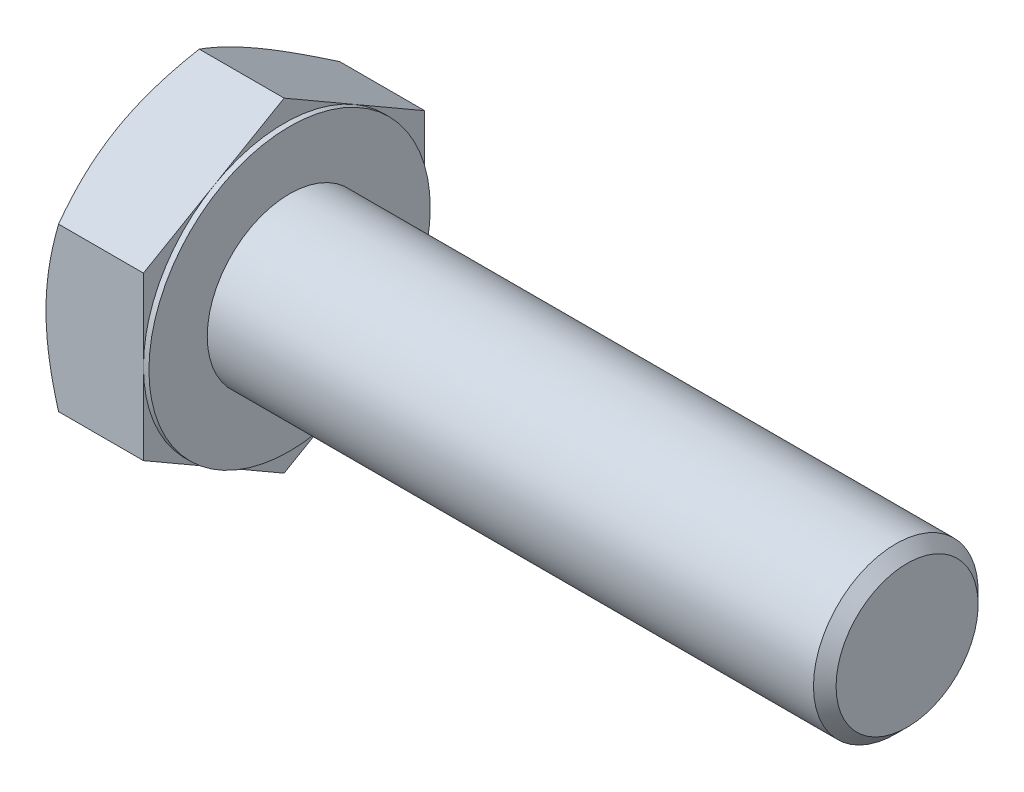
from build123d import *

# Parameters (mm, degrees)
BASEHEAD_DEPTH = 15
SKETCH4_W      = 0.8
SKETCH4_H      = 13.171361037


with BuildPart() as part:
    # Sketch1 → BaseHead (new body)
    with BuildSketch(Plane(origin=(0, 0, 0), x_dir=(0, 0, -1), z_dir=(1, 0, 0))):
        Polygon((20.5, 11.835680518), (20.5, -11.835680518), (0, -23.671361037), (-20.5, -11.835680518), (-20.5, 11.835680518), (0, 23.671361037), align=None)
    extrude(amount=BASEHEAD_DEPTH)

    # BodySke → BaseBody (revolve)
    with BuildSketch(Plane.XY, mode=Mode.PRIVATE) as basebody_sk:
        Polygon((0, 0), (105, 0), (105, 10.352), (103.352, 12), (0, 12), align=None)
    revolve(basebody_sk.sketch.rotate(Axis((0, 0, 0), (1, 0, 0)), 90), axis=Axis((0, 0, 0), (1, 0, 0)))

    # Sketch3 → HeadChamfer (revolve, cut)
    with BuildSketch(Plane.XY):
        Polygon((0, 20.5), (4.717737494, 28.671361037), (4.717737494, 33.671361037), (-10, 33.671361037), (-10, 20.5), align=None)
    revolve(axis=Axis((0, 0, 0), (1, 0, 0)), mode=Mode.SUBTRACT)

    # Sketch4 → BearingFace (revolve, cut)
    with BuildSketch(Plane.XY, mode=Mode.PRIVATE) as bearingface_sk:
        with Locations((14.6, 27.085680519)):
            Rectangle(SKETCH4_W, SKETCH4_H)
    revolve(bearingface_sk.sketch.rotate(Axis((0, 0, 0), (1, 0, 0)), 270), axis=Axis((0, 0, 0), (1, 0, 0)), mode=Mode.SUBTRACT)


solid = part.part
